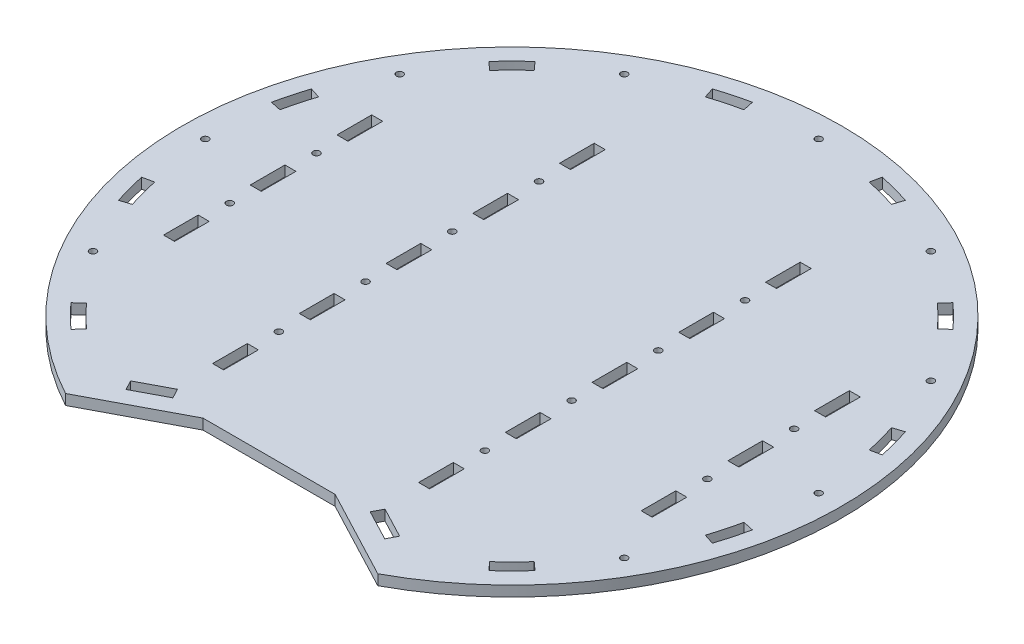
from build123d import *

# Parameters (mm, degrees)
SKETCH1_R           = 1.9558
SKETCH1_W           = 6.35
SKETCH1_H           = 20
BOSS_EXTRUDE1_DEPTH = 6


with BuildPart() as part:
    # Sketch1 → Boss-Extrude1 (new body)
    with BuildSketch(Plane(origin=(0, 0, 0), x_dir=(1, 0, 0), z_dir=(0, 1, 0))):
        with BuildLine():
            Line((-90, -167.332005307), (-38.1, -140))
            Line((-38.1, -140), (38.1, -140))
            Line((38.1, -140), (90, -167.332005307))
            ThreePointArc((90, -167.332005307), (0, 190), (-90, -167.332005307))
        make_face()
        with Locations(Location((-137.675, 25, 0), (0, 0, 270))):
            Circle(SKETCH1_R, mode=Mode.SUBTRACT)
        with Locations(Location((-137.675, -25, 0), (0, 0, 270))):
            Circle(SKETCH1_R, mode=Mode.SUBTRACT)
        with Locations(Location((-59.378328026, -25, 0), (0, 0, 270))):
            Circle(SKETCH1_R, mode=Mode.SUBTRACT)
        with Locations(Location((-59.378328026, -75, 0), (0, 0, 270))):
            Circle(SKETCH1_R, mode=Mode.SUBTRACT)
        with Locations(Location((-59.378328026, 25, 0), (0, 0, 270))):
            Circle(SKETCH1_R, mode=Mode.SUBTRACT)
        with Locations(Location((-59.378328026, 75, 0), (0, 0, 270))):
            Circle(SKETCH1_R, mode=Mode.SUBTRACT)
        with Locations(Location((0, 176.805718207, 0), (0, 0, 270))):
            Circle(SKETCH1_R, mode=Mode.SUBTRACT)
        with Locations(Location((-88.402859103, 153.118243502, 0), (0, 0, 270))):
            Circle(SKETCH1_R, mode=Mode.SUBTRACT)
        with Locations(Location((-153.118243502, 88.402859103, 0), (0, 0, 270))):
            Circle(SKETCH1_R, mode=Mode.SUBTRACT)
        with Locations(Location((-176.805718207, 0, 0), (0, 0, 270))):
            Circle(SKETCH1_R, mode=Mode.SUBTRACT)
        with Locations(Location((-153.118243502, -88.402859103, 0), (0, 0, 270))):
            Circle(SKETCH1_R, mode=Mode.SUBTRACT)
        with Locations(Location((88.402859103, 153.118243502, 0), (0, 0, 270))):
            Circle(SKETCH1_R, mode=Mode.SUBTRACT)
        with Locations(Location((59.378328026, -75, 0), (0, 0, 270))):
            Circle(SKETCH1_R, mode=Mode.SUBTRACT)
        with Locations(Location((153.118243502, -88.402859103, 0), (0, 0, 270))):
            Circle(SKETCH1_R, mode=Mode.SUBTRACT)
        with Locations(Location((176.805718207, 0, 0), (0, 0, 270))):
            Circle(SKETCH1_R, mode=Mode.SUBTRACT)
        with Locations(Location((153.118243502, 88.402859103, 0), (0, 0, 270))):
            Circle(SKETCH1_R, mode=Mode.SUBTRACT)
        with Locations(Location((137.675, -25, 0), (0, 0, 270))):
            Circle(SKETCH1_R, mode=Mode.SUBTRACT)
        with Locations(Location((59.378328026, -25, 0), (0, 0, 270))):
            Circle(SKETCH1_R, mode=Mode.SUBTRACT)
        with Locations(Location((59.378328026, 25, 0), (0, 0, 270))):
            Circle(SKETCH1_R, mode=Mode.SUBTRACT)
        with Locations(Location((137.675, 25, 0), (0, 0, 270))):
            Circle(SKETCH1_R, mode=Mode.SUBTRACT)
        with Locations(Location((59.378328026, 75, 0), (0, 0, 270))):
            Circle(SKETCH1_R, mode=Mode.SUBTRACT)
        with Locations((137.675, -50)):
            Rectangle(SKETCH1_W, SKETCH1_H, mode=Mode.SUBTRACT)
        with Locations((-137.675, 50)):
            Rectangle(SKETCH1_W, SKETCH1_H, mode=Mode.SUBTRACT)
        with Locations((-137.675, 0)):
            Rectangle(SKETCH1_W, SKETCH1_H, mode=Mode.SUBTRACT)
        with Locations((-137.675, -50)):
            Rectangle(SKETCH1_W, SKETCH1_H, mode=Mode.SUBTRACT)
        with Locations((137.675, 0)):
            Rectangle(SKETCH1_W, SKETCH1_H, mode=Mode.SUBTRACT)
        with Locations((137.675, 50)):
            Rectangle(SKETCH1_W, SKETCH1_H, mode=Mode.SUBTRACT)
        with BuildLine():
            Line((-53.660801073, 165.150964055), (-55.623058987, 171.190172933))
            ThreePointArc((-55.623058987, 171.190172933), (-46.587428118, 173.866648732), (-37.424104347, 176.066568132))
            Line((-37.424104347, 176.066568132), (-36.103865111, 169.855330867))
            ThreePointArc((-36.103865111, 169.855330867), (-44.943927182, 167.733019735), (-53.660801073, 165.150964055))
        make_face(mode=Mode.SUBTRACT)
        with BuildLine():
            Line((-120.443509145, 133.766068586), (-116.194529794, 129.047098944))
            ThreePointArc((-116.194529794, 129.047098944), (-122.789092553, 122.789092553), (-129.047098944, 116.194529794))
            Line((-129.047098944, 116.194529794), (-133.766068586, 120.443509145))
            ThreePointArc((-133.766068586, 120.443509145), (-127.279220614, 127.279220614), (-120.443509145, 133.766068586))
        make_face(mode=Mode.SUBTRACT)
        with BuildLine():
            Line((-171.190172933, 55.623058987), (-165.150964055, 53.660801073))
            ThreePointArc((-165.150964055, 53.660801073), (-167.733019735, 44.943927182), (-169.855330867, 36.103865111))
            Line((-169.855330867, 36.103865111), (-176.066568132, 37.424104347))
            ThreePointArc((-176.066568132, 37.424104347), (-173.866648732, 46.587428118), (-171.190172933, 55.623058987))
        make_face(mode=Mode.SUBTRACT)
        with BuildLine():
            Line((-176.066568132, -37.424104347), (-169.855330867, -36.103865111))
            ThreePointArc((-169.855330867, -36.103865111), (-167.733019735, -44.943927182), (-165.150964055, -53.660801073))
            Line((-165.150964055, -53.660801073), (-171.190172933, -55.623058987))
            ThreePointArc((-171.190172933, -55.623058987), (-173.866648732, -46.587428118), (-176.066568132, -37.424104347))
        make_face(mode=Mode.SUBTRACT)
        with BuildLine():
            Line((-133.766068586, -120.443509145), (-129.047098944, -116.194529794))
            ThreePointArc((-129.047098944, -116.194529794), (-122.789092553, -122.789092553), (-116.194529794, -129.047098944))
            Line((-116.194529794, -129.047098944), (-120.443509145, -133.766068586))
            ThreePointArc((-120.443509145, -133.766068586), (-127.279220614, -127.279220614), (-133.766068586, -120.443509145))
        make_face(mode=Mode.SUBTRACT)
        with Locations((59.378328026, 0)):
            Rectangle(SKETCH1_W, SKETCH1_H, mode=Mode.SUBTRACT)
        with BuildLine():
            Line((116.194529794, -129.047098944), (120.443509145, -133.766068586))
            ThreePointArc((120.443509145, -133.766068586), (127.279220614, -127.279220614), (133.766068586, -120.443509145))
            Line((133.766068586, -120.443509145), (129.047098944, -116.194529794))
            ThreePointArc((129.047098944, -116.194529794), (122.789092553, -122.789092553), (116.194529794, -129.047098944))
        make_face(mode=Mode.SUBTRACT)
        with BuildLine():
            Line((165.150964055, -53.660801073), (171.190172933, -55.623058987))
            ThreePointArc((171.190172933, -55.623058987), (173.866648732, -46.587428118), (176.066568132, -37.424104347))
            Line((176.066568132, -37.424104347), (169.855330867, -36.103865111))
            ThreePointArc((169.855330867, -36.103865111), (167.733019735, -44.943927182), (165.150964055, -53.660801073))
        make_face(mode=Mode.SUBTRACT)
        with BuildLine():
            Line((169.855330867, 36.103865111), (176.066568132, 37.424104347))
            ThreePointArc((176.066568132, 37.424104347), (173.866648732, 46.587428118), (171.190172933, 55.623058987))
            Line((171.190172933, 55.623058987), (165.150964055, 53.660801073))
            ThreePointArc((165.150964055, 53.660801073), (167.733019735, 44.943927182), (169.855330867, 36.103865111))
        make_face(mode=Mode.SUBTRACT)
        with BuildLine():
            Line((129.047098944, 116.194529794), (133.766068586, 120.443509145))
            ThreePointArc((133.766068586, 120.443509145), (127.279220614, 127.279220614), (120.443509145, 133.766068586))
            Line((120.443509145, 133.766068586), (116.194529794, 129.047098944))
            ThreePointArc((116.194529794, 129.047098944), (122.789092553, 122.789092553), (129.047098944, 116.194529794))
        make_face(mode=Mode.SUBTRACT)
        with BuildLine():
            Line((37.424104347, 176.066568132), (36.103865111, 169.855330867))
            ThreePointArc((36.103865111, 169.855330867), (44.943927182, 167.733019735), (53.660801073, 165.150964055))
            Line((53.660801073, 165.150964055), (55.623058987, 171.190172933))
            ThreePointArc((55.623058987, 171.190172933), (46.587428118, 173.866648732), (37.424104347, 176.066568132))
        make_face(mode=Mode.SUBTRACT)
        Polygon((-56.879281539, -138.587765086), (-59.838145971, -132.969258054), (-77.534231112, -142.288516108), (-74.57536668, -147.90702314), align=None, mode=Mode.SUBTRACT)
        Polygon((77.534231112, -142.288516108), (74.57536668, -147.90702314), (56.879281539, -138.587765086), (59.838145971, -132.969258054), align=None, mode=Mode.SUBTRACT)
        with Locations((-59.378328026, 50)):
            Rectangle(SKETCH1_W, SKETCH1_H, mode=Mode.SUBTRACT)
        with Locations((-59.378328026, 0)):
            Rectangle(SKETCH1_W, SKETCH1_H, mode=Mode.SUBTRACT)
        with Locations((-59.378328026, 100)):
            Rectangle(SKETCH1_W, SKETCH1_H, mode=Mode.SUBTRACT)
        with Locations((-59.378328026, -50)):
            Rectangle(SKETCH1_W, SKETCH1_H, mode=Mode.SUBTRACT)
        with Locations((-59.378328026, -100)):
            Rectangle(SKETCH1_W, SKETCH1_H, mode=Mode.SUBTRACT)
        with Locations((59.378328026, -50)):
            Rectangle(SKETCH1_W, SKETCH1_H, mode=Mode.SUBTRACT)
        with Locations((59.378328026, -100)):
            Rectangle(SKETCH1_W, SKETCH1_H, mode=Mode.SUBTRACT)
        with Locations((59.378328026, 100)):
            Rectangle(SKETCH1_W, SKETCH1_H, mode=Mode.SUBTRACT)
        with Locations((59.378328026, 50)):
            Rectangle(SKETCH1_W, SKETCH1_H, mode=Mode.SUBTRACT)
    extrude(amount=BOSS_EXTRUDE1_DEPTH)


solid = part.part
